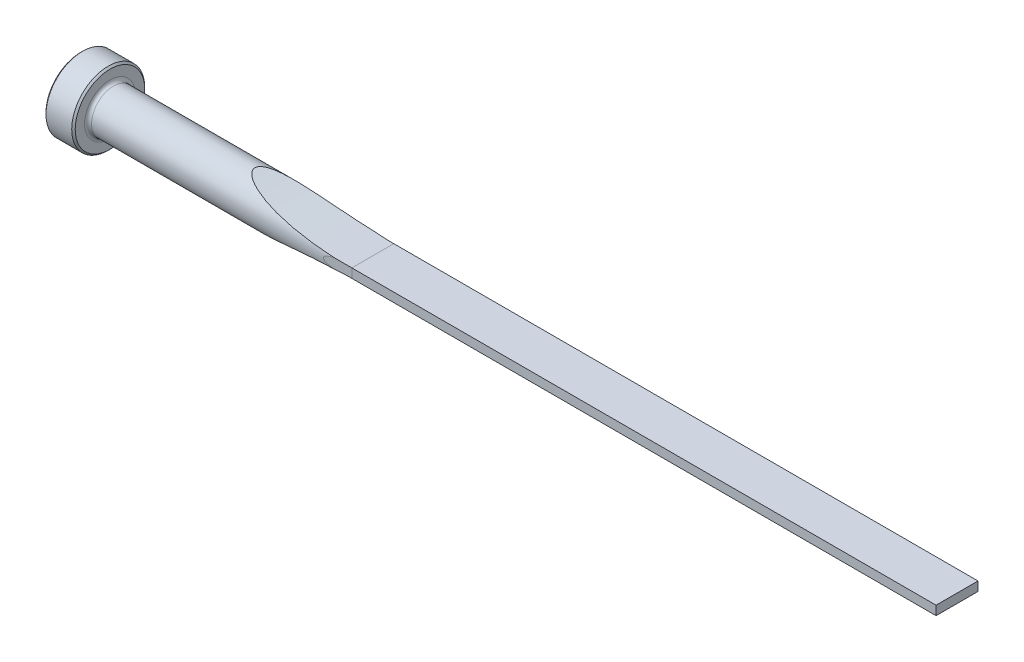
from build123d import *

# Parameters (mm, degrees)
CUT_EXTRUDE1_DEPTH = 191.830442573
CUT_EXTRUDE2_DEPTH = 191.830442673
FILLET1_R          = 0.762
CHAMFER1_SIZE      = 0.381


with BuildPart() as part:
    # Sketch1 → Revolve1 (revolve)
    with BuildSketch(Plane.XY, mode=Mode.PRIVATE) as revolve1_sk:
        Polygon((0, 0), (0, 7.9375), (6.35, 7.9375), (6.35, 4.7625), (190.5, 4.7625), (190.5, 0), align=None)
    revolve(revolve1_sk.sketch.rotate(Axis((0, 0, 0), (1, 0, 0)), 90), axis=Axis((0, 0, 0), (1, 0, 0)))

    # Sketch2 → Cut-Extrude1 (cut, symmetric)
    with BuildSketch(Plane.XY):
        with BuildLine():
            Line((190.5, 4.7625), (190.5, 0.9906))
            Line((190.5, 0.9906), (63.5, 0.9906))
            ThreePointArc((63.5, 0.9906), (50.551604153, 1.938629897), (37.87937178, 4.7625))
            Line((37.87937178, 4.7625), (190.5, 4.7625))
        make_face()
    cut_extrude1 = extrude(amount=CUT_EXTRUDE1_DEPTH, both=True, mode=Mode.SUBTRACT)

    # Mirror1: Cut-Extrude1 across plane
    add(cut_extrude1.mirror(Plane.ZX), mode=Mode.SUBTRACT)

    # Sketch3 → Cut-Extrude2 (cut, symmetric)
    with BuildSketch(Plane(origin=(0, 0, 0), x_dir=(1, 0, 0), z_dir=(0, 1, 0))):
        with BuildLine():
            Line((190.5, 4.7625), (190.5, 4.5593))
            Line((190.5, 4.5593), (63.5, 4.5593))
            ThreePointArc((63.5, 4.5593), (60.49463147, 4.610114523), (57.492698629, 4.7625))
            Line((57.492698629, 4.7625), (190.5, 4.7625))
        make_face()
    cut_extrude2 = extrude(amount=CUT_EXTRUDE2_DEPTH, both=True, mode=Mode.SUBTRACT)

    # Mirror2: Cut-Extrude2 across plane
    add(cut_extrude2.mirror(Plane.XY), mode=Mode.SUBTRACT)

    # Fillet1
    fillet1_edges = [part.edges().sort_by_distance(p)[0] for p in [
        (6.35, 0, -4.7625),
    ]]
    fillet(fillet1_edges, radius=FILLET1_R)

    # Chamfer1
    chamfer1_edges = [part.edges().sort_by_distance(p)[0] for p in [
        (6.35, 0, -7.9375),
        (0, 0, -7.9375),
    ]]
    chamfer(chamfer1_edges, length=CHAMFER1_SIZE)


solid = part.part
